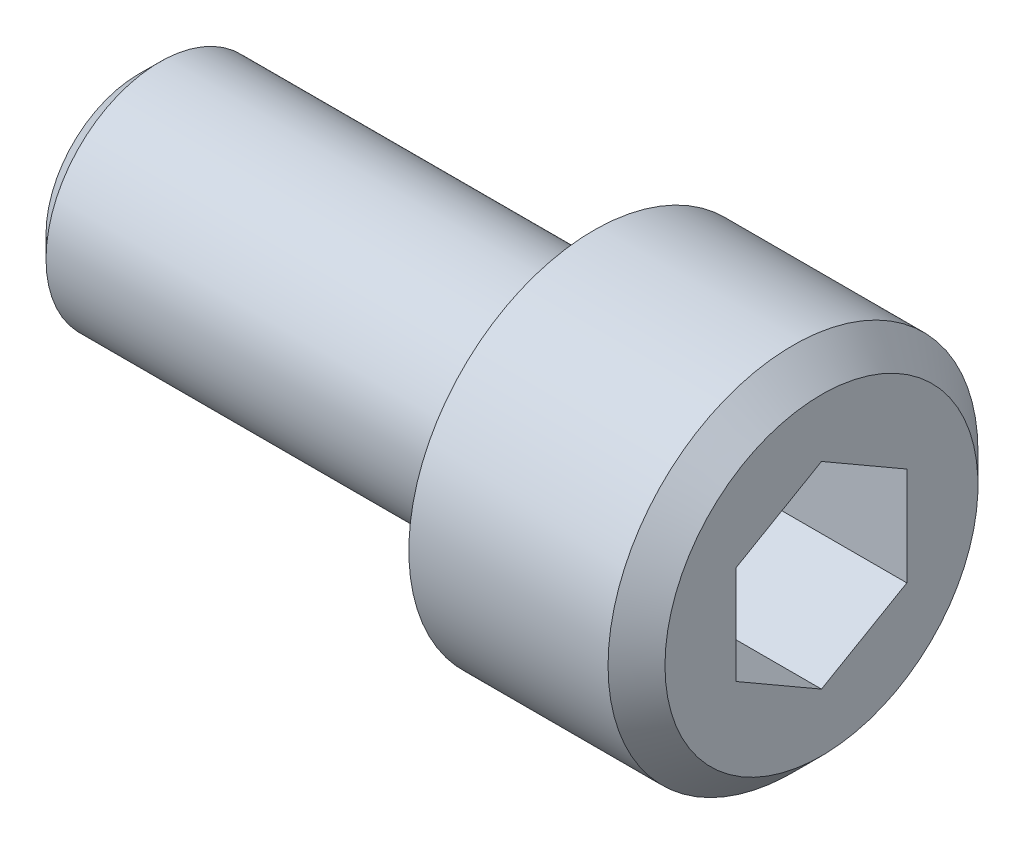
ISO-10303-21;
HEADER;
FILE_DESCRIPTION(('STEP AP214'),'2;1');
FILE_NAME('part.step','',(''),(''),'','','');
FILE_SCHEMA(('AUTOMOTIVE_DESIGN { 1 0 10303 214 1 1 1 1 }'));
ENDSEC;
DATA;
#1=APPLICATION_CONTEXT('core data for automotive mechanical design processes');
#2=APPLICATION_PROTOCOL_DEFINITION('international standard','automotive_design',2000,#1);
#3=PRODUCT_CONTEXT('',#1,'mechanical');
#4=PRODUCT('Part','Part','',(#3));
#5=PRODUCT_RELATED_PRODUCT_CATEGORY('part','',(#4));
#6=PRODUCT_DEFINITION_FORMATION('','',#4);
#7=PRODUCT_DEFINITION_CONTEXT('part definition',#1,'design');
#8=PRODUCT_DEFINITION('design','',#6,#7);
#9=PRODUCT_DEFINITION_SHAPE('','',#8);
#10=(LENGTH_UNIT() NAMED_UNIT(*) SI_UNIT(.MILLI.,.METRE.));
#11=(NAMED_UNIT(*) PLANE_ANGLE_UNIT() SI_UNIT($,.RADIAN.));
#12=(NAMED_UNIT(*) SI_UNIT($,.STERADIAN.) SOLID_ANGLE_UNIT());
#13=UNCERTAINTY_MEASURE_WITH_UNIT(LENGTH_MEASURE(1.E-05),#10,'distance_accuracy_value','');
#14=(GEOMETRIC_REPRESENTATION_CONTEXT(3) GLOBAL_UNCERTAINTY_ASSIGNED_CONTEXT((#13)) GLOBAL_UNIT_ASSIGNED_CONTEXT((#10,
#11,#12)) REPRESENTATION_CONTEXT('',''));
#15=CARTESIAN_POINT('',(0.,0.,0.));
#16=DIRECTION('',(0.,0.,1.));
#17=DIRECTION('',(1.,0.,0.));
#18=AXIS2_PLACEMENT_3D('',#15,#16,#17);
#19=CARTESIAN_POINT('',(19.,0.,0.));
#20=DIRECTION('',(1.,0.,0.));
#21=DIRECTION('',(0.,0.,-1.));
#22=AXIS2_PLACEMENT_3D('',#19,#20,#21);
#23=PLANE('',#22);
#24=DIRECTION('',(0.,-0.5,0.866025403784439));
#25=VECTOR('',#24,1.);
#26=CARTESIAN_POINT('',(19.,3.46410161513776,0.));
#27=LINE('',#26,#25);
#28=CARTESIAN_POINT('',(19.,3.46410161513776,0.));
#29=VERTEX_POINT('',#28);
#30=CARTESIAN_POINT('',(19.,1.73205080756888,3.));
#31=VERTEX_POINT('',#30);
#32=EDGE_CURVE('E83',#29,#31,#27,.T.);
#33=ORIENTED_EDGE('',*,*,#32,.T.);
#34=DIRECTION('',(0.,1.,0.));
#35=VECTOR('',#34,1.);
#36=CARTESIAN_POINT('',(19.,1.73205080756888,3.));
#37=LINE('',#36,#35);
#38=CARTESIAN_POINT('',(19.,-1.73205080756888,3.));
#39=VERTEX_POINT('',#38);
#40=EDGE_CURVE('E67',#31,#39,#37,.F.);
#41=ORIENTED_EDGE('',*,*,#40,.T.);
#42=DIRECTION('',(0.,-0.5,-0.866025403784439));
#43=VECTOR('',#42,1.);
#44=CARTESIAN_POINT('',(19.,-1.73205080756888,3.));
#45=LINE('',#44,#43);
#46=CARTESIAN_POINT('',(19.,-3.46410161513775,0.));
#47=VERTEX_POINT('',#46);
#48=EDGE_CURVE('E72',#39,#47,#45,.T.);
#49=ORIENTED_EDGE('',*,*,#48,.T.);
#50=DIRECTION('',(0.,0.5,-0.866025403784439));
#51=VECTOR('',#50,1.);
#52=CARTESIAN_POINT('',(19.,-3.46410161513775,0.));
#53=LINE('',#52,#51);
#54=CARTESIAN_POINT('',(19.,-1.73205080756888,-3.));
#55=VERTEX_POINT('',#54);
#56=EDGE_CURVE('E128',#47,#55,#53,.T.);
#57=ORIENTED_EDGE('',*,*,#56,.T.);
#58=DIRECTION('',(0.,1.,0.));
#59=VECTOR('',#58,1.);
#60=CARTESIAN_POINT('',(19.,-1.73205080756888,-3.));
#61=LINE('',#60,#59);
#62=CARTESIAN_POINT('',(19.,1.73205080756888,-3.));
#63=VERTEX_POINT('',#62);
#64=EDGE_CURVE('E132',#55,#63,#61,.T.);
#65=ORIENTED_EDGE('',*,*,#64,.T.);
#66=DIRECTION('',(0.,0.5,0.866025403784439));
#67=VECTOR('',#66,1.);
#68=CARTESIAN_POINT('',(19.,1.73205080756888,-3.));
#69=LINE('',#68,#67);
#70=EDGE_CURVE('E137',#63,#29,#69,.T.);
#71=ORIENTED_EDGE('',*,*,#70,.T.);
#72=EDGE_LOOP('',(#33,#41,#49,#57,#65,#71));
#73=FACE_BOUND('',#72,.T.);
#74=ADVANCED_FACE('F17',(#73),#23,.T.);
#75=CARTESIAN_POINT('',(24.,-1.73205080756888,3.));
#76=DIRECTION('',(0.,-0.866025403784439,0.5));
#77=DIRECTION('',(0.,-0.5,-0.866025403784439));
#78=AXIS2_PLACEMENT_3D('',#75,#76,#77);
#79=PLANE('',#78);
#80=DIRECTION('',(1.,0.,0.));
#81=VECTOR('',#80,1.);
#82=CARTESIAN_POINT('',(24.,-1.73205080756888,3.));
#83=LINE('',#82,#81);
#84=CARTESIAN_POINT('',(24.,-1.73205080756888,3.));
#85=VERTEX_POINT('',#84);
#86=EDGE_CURVE('E74',#39,#85,#83,.T.);
#87=ORIENTED_EDGE('',*,*,#86,.T.);
#88=DIRECTION('',(0.,0.5,0.866025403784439));
#89=VECTOR('',#88,1.);
#90=CARTESIAN_POINT('',(24.,-3.46410161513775,0.));
#91=LINE('',#90,#89);
#92=CARTESIAN_POINT('',(24.,-3.46410161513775,0.));
#93=VERTEX_POINT('',#92);
#94=EDGE_CURVE('E126',#93,#85,#91,.T.);
#95=ORIENTED_EDGE('',*,*,#94,.F.);
#96=DIRECTION('',(1.,0.,0.));
#97=VECTOR('',#96,1.);
#98=CARTESIAN_POINT('',(24.,-3.46410161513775,0.));
#99=LINE('',#98,#97);
#100=EDGE_CURVE('E77',#93,#47,#99,.F.);
#101=ORIENTED_EDGE('',*,*,#100,.T.);
#102=ORIENTED_EDGE('',*,*,#48,.F.);
#103=EDGE_LOOP('',(#87,#95,#101,#102));
#104=FACE_BOUND('',#103,.T.);
#105=ADVANCED_FACE('F73',(#104),#79,.F.);
#106=CARTESIAN_POINT('',(24.,1.73205080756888,3.));
#107=DIRECTION('',(0.,0.,1.));
#108=DIRECTION('',(1.,0.,0.));
#109=AXIS2_PLACEMENT_3D('',#106,#107,#108);
#110=PLANE('',#109);
#111=DIRECTION('',(1.,0.,0.));
#112=VECTOR('',#111,1.);
#113=CARTESIAN_POINT('',(24.,1.73205080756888,3.));
#114=LINE('',#113,#112);
#115=CARTESIAN_POINT('',(24.,1.73205080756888,3.));
#116=VERTEX_POINT('',#115);
#117=EDGE_CURVE('E85',#31,#116,#114,.T.);
#118=ORIENTED_EDGE('',*,*,#117,.T.);
#119=DIRECTION('',(0.,1.,0.));
#120=VECTOR('',#119,1.);
#121=CARTESIAN_POINT('',(24.,2.75,3.));
#122=LINE('',#121,#120);
#123=EDGE_CURVE('E89',#85,#116,#122,.T.);
#124=ORIENTED_EDGE('',*,*,#123,.F.);
#125=ORIENTED_EDGE('',*,*,#86,.F.);
#126=ORIENTED_EDGE('',*,*,#40,.F.);
#127=EDGE_LOOP('',(#118,#124,#125,#126));
#128=FACE_BOUND('',#127,.T.);
#129=ADVANCED_FACE('F87',(#128),#110,.F.);
#130=CARTESIAN_POINT('',(24.,3.46410161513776,0.));
#131=DIRECTION('',(0.,0.866025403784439,0.5));
#132=DIRECTION('',(0.,-0.5,0.866025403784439));
#133=AXIS2_PLACEMENT_3D('',#130,#131,#132);
#134=PLANE('',#133);
#135=DIRECTION('',(1.,0.,0.));
#136=VECTOR('',#135,1.);
#137=CARTESIAN_POINT('',(24.,3.46410161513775,0.));
#138=LINE('',#137,#136);
#139=CARTESIAN_POINT('',(24.,3.46410161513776,0.));
#140=VERTEX_POINT('',#139);
#141=EDGE_CURVE('E139',#29,#140,#138,.T.);
#142=ORIENTED_EDGE('',*,*,#141,.T.);
#143=DIRECTION('',(0.,0.5,-0.866025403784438));
#144=VECTOR('',#143,1.);
#145=CARTESIAN_POINT('',(24.,1.73205080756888,3.));
#146=LINE('',#145,#144);
#147=EDGE_CURVE('E122',#116,#140,#146,.T.);
#148=ORIENTED_EDGE('',*,*,#147,.F.);
#149=ORIENTED_EDGE('',*,*,#117,.F.);
#150=ORIENTED_EDGE('',*,*,#32,.F.);
#151=EDGE_LOOP('',(#142,#148,#149,#150));
#152=FACE_BOUND('',#151,.T.);
#153=ADVANCED_FACE('F143',(#152),#134,.F.);
#154=CARTESIAN_POINT('',(24.,1.73205080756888,-3.));
#155=DIRECTION('',(0.,0.866025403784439,-0.5));
#156=DIRECTION('',(0.,0.5,0.866025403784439));
#157=AXIS2_PLACEMENT_3D('',#154,#155,#156);
#158=PLANE('',#157);
#159=DIRECTION('',(-1.,0.,0.));
#160=VECTOR('',#159,1.);
#161=CARTESIAN_POINT('',(24.,1.73205080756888,-3.));
#162=LINE('',#161,#160);
#163=CARTESIAN_POINT('',(24.,1.73205080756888,-3.));
#164=VERTEX_POINT('',#163);
#165=EDGE_CURVE('E135',#63,#164,#162,.F.);
#166=ORIENTED_EDGE('',*,*,#165,.T.);
#167=DIRECTION('',(0.,-0.5,-0.866025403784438));
#168=VECTOR('',#167,1.);
#169=CARTESIAN_POINT('',(24.,3.46410161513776,0.));
#170=LINE('',#169,#168);
#171=EDGE_CURVE('E119',#140,#164,#170,.T.);
#172=ORIENTED_EDGE('',*,*,#171,.F.);
#173=ORIENTED_EDGE('',*,*,#141,.F.);
#174=ORIENTED_EDGE('',*,*,#70,.F.);
#175=EDGE_LOOP('',(#166,#172,#173,#174));
#176=FACE_BOUND('',#175,.T.);
#177=ADVANCED_FACE('F154',(#176),#158,.F.);
#178=CARTESIAN_POINT('',(24.,-1.73205080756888,-3.));
#179=DIRECTION('',(0.,0.,-1.));
#180=DIRECTION('',(-1.,0.,0.));
#181=AXIS2_PLACEMENT_3D('',#178,#179,#180);
#182=PLANE('',#181);
#183=DIRECTION('',(1.,0.,0.));
#184=VECTOR('',#183,1.);
#185=CARTESIAN_POINT('',(24.,-1.73205080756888,-3.));
#186=LINE('',#185,#184);
#187=CARTESIAN_POINT('',(24.,-1.73205080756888,-3.));
#188=VERTEX_POINT('',#187);
#189=EDGE_CURVE('E35',#55,#188,#186,.T.);
#190=ORIENTED_EDGE('',*,*,#189,.T.);
#191=DIRECTION('',(0.,1.,0.));
#192=VECTOR('',#191,1.);
#193=CARTESIAN_POINT('',(24.,2.75,-3.));
#194=LINE('',#193,#192);
#195=EDGE_CURVE('E116',#164,#188,#194,.F.);
#196=ORIENTED_EDGE('',*,*,#195,.F.);
#197=ORIENTED_EDGE('',*,*,#165,.F.);
#198=ORIENTED_EDGE('',*,*,#64,.F.);
#199=EDGE_LOOP('',(#190,#196,#197,#198));
#200=FACE_BOUND('',#199,.T.);
#201=ADVANCED_FACE('F152',(#200),#182,.F.);
#202=CARTESIAN_POINT('',(24.,-3.46410161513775,0.));
#203=DIRECTION('',(0.,-0.866025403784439,-0.5));
#204=DIRECTION('',(0.,0.5,-0.866025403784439));
#205=AXIS2_PLACEMENT_3D('',#202,#203,#204);
#206=PLANE('',#205);
#207=ORIENTED_EDGE('',*,*,#100,.F.);
#208=DIRECTION('',(0.,-0.5,0.866025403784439));
#209=VECTOR('',#208,1.);
#210=CARTESIAN_POINT('',(24.,-1.73205080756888,-3.));
#211=LINE('',#210,#209);
#212=EDGE_CURVE('E108',#188,#93,#211,.T.);
#213=ORIENTED_EDGE('',*,*,#212,.F.);
#214=ORIENTED_EDGE('',*,*,#189,.F.);
#215=ORIENTED_EDGE('',*,*,#56,.F.);
#216=EDGE_LOOP('',(#207,#213,#214,#215));
#217=FACE_BOUND('',#216,.T.);
#218=ADVANCED_FACE('F150',(#217),#206,.F.);
#219=CARTESIAN_POINT('',(24.,2.75,0.));
#220=DIRECTION('',(1.,0.,0.));
#221=DIRECTION('',(0.,0.,-1.));
#222=AXIS2_PLACEMENT_3D('',#219,#220,#221);
#223=PLANE('',#222);
#224=ORIENTED_EDGE('',*,*,#195,.T.);
#225=ORIENTED_EDGE('',*,*,#212,.T.);
#226=ORIENTED_EDGE('',*,*,#94,.T.);
#227=ORIENTED_EDGE('',*,*,#123,.T.);
#228=ORIENTED_EDGE('',*,*,#147,.T.);
#229=ORIENTED_EDGE('',*,*,#171,.T.);
#230=EDGE_LOOP('',(#224,#225,#226,#227,#228,#229));
#231=FACE_BOUND('',#230,.T.);
#232=CARTESIAN_POINT('',(24.0000000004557,0.,0.));
#233=DIRECTION('',(-1.,0.,0.));
#234=DIRECTION('',(0.,0.,1.));
#235=AXIS2_PLACEMENT_3D('',#232,#233,#234);
#236=CIRCLE('',#235,5.50000000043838);
#237=CARTESIAN_POINT('',(24.0000000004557,0.,5.50000000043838));
#238=VERTEX_POINT('',#237);
#239=EDGE_CURVE('E20',#238,#238,#236,.T.);
#240=ORIENTED_EDGE('',*,*,#239,.F.);
#241=EDGE_LOOP('',(#240));
#242=FACE_BOUND('',#241,.T.);
#243=ADVANCED_FACE('F147',(#231,#242),#223,.T.);
#244=CARTESIAN_POINT('',(22.9999999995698,0.,0.));
#245=DIRECTION('',(-1.,0.,0.));
#246=DIRECTION('',(0.,0.,1.));
#247=AXIS2_PLACEMENT_3D('',#244,#245,#246);
#248=CONICAL_SURFACE('',#247,6.49999999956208,0.785398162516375);
#249=CARTESIAN_POINT('',(23.,0.,0.));
#250=DIRECTION('',(1.,0.,0.));
#251=DIRECTION('',(0.,0.,-1.));
#252=AXIS2_PLACEMENT_3D('',#249,#250,#251);
#253=CIRCLE('',#252,6.5);
#254=CARTESIAN_POINT('',(23.,0.,-6.5));
#255=VERTEX_POINT('',#254);
#256=EDGE_CURVE('E100',#255,#255,#253,.F.);
#257=ORIENTED_EDGE('',*,*,#256,.F.);
#258=EDGE_LOOP('',(#257));
#259=FACE_BOUND('',#258,.T.);
#260=ORIENTED_EDGE('',*,*,#239,.T.);
#261=EDGE_LOOP('',(#260));
#262=FACE_BOUND('',#261,.T.);
#263=ADVANCED_FACE('F187',(#259,#262),#248,.T.);
#264=CARTESIAN_POINT('',(19.5,0.,0.));
#265=DIRECTION('',(1.,0.,0.));
#266=DIRECTION('',(0.,0.,-1.));
#267=AXIS2_PLACEMENT_3D('',#264,#265,#266);
#268=CYLINDRICAL_SURFACE('',#267,6.5);
#269=CARTESIAN_POINT('',(16.,0.,0.));
#270=DIRECTION('',(1.,0.,0.));
#271=DIRECTION('',(0.,0.,-1.));
#272=AXIS2_PLACEMENT_3D('',#269,#270,#271);
#273=CIRCLE('',#272,6.5);
#274=CARTESIAN_POINT('',(16.,0.,-6.5));
#275=VERTEX_POINT('',#274);
#276=EDGE_CURVE('E98',#275,#275,#273,.F.);
#277=ORIENTED_EDGE('',*,*,#276,.F.);
#278=EDGE_LOOP('',(#277));
#279=FACE_BOUND('',#278,.T.);
#280=ORIENTED_EDGE('',*,*,#256,.T.);
#281=EDGE_LOOP('',(#280));
#282=FACE_BOUND('',#281,.T.);
#283=ADVANCED_FACE('F183',(#279,#282),#268,.T.);
#284=CARTESIAN_POINT('',(0.,1.625,0.));
#285=DIRECTION('',(-1.,0.,0.));
#286=DIRECTION('',(0.,0.,1.));
#287=AXIS2_PLACEMENT_3D('',#284,#285,#286);
#288=PLANE('',#287);
#289=CARTESIAN_POINT('',(-2.8421709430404E-10,0.,0.));
#290=DIRECTION('',(1.,0.,0.));
#291=DIRECTION('',(0.,0.,-1.));
#292=AXIS2_PLACEMENT_3D('',#289,#290,#291);
#293=CIRCLE('',#292,3.2500000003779);
#294=CARTESIAN_POINT('',(-2.8421709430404E-10,0.,-3.2500000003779));
#295=VERTEX_POINT('',#294);
#296=EDGE_CURVE('E96',#295,#295,#293,.T.);
#297=ORIENTED_EDGE('',*,*,#296,.F.);
#298=EDGE_LOOP('',(#297));
#299=FACE_BOUND('',#298,.T.);
#300=ADVANCED_FACE('F179',(#299),#288,.T.);
#301=CARTESIAN_POINT('',(16.,5.25,0.));
#302=DIRECTION('',(-1.,0.,0.));
#303=DIRECTION('',(0.,0.,1.));
#304=AXIS2_PLACEMENT_3D('',#301,#302,#303);
#305=PLANE('',#304);
#306=CARTESIAN_POINT('',(16.,0.,0.));
#307=DIRECTION('',(1.,0.,0.));
#308=DIRECTION('',(0.,0.,-1.));
#309=AXIS2_PLACEMENT_3D('',#306,#307,#308);
#310=CIRCLE('',#309,4.);
#311=CARTESIAN_POINT('',(16.,0.,-4.));
#312=VERTEX_POINT('',#311);
#313=EDGE_CURVE('E26',#312,#312,#310,.F.);
#314=ORIENTED_EDGE('',*,*,#313,.F.);
#315=EDGE_LOOP('',(#314));
#316=FACE_BOUND('',#315,.T.);
#317=ORIENTED_EDGE('',*,*,#276,.T.);
#318=EDGE_LOOP('',(#317));
#319=FACE_BOUND('',#318,.T.);
#320=ADVANCED_FACE('F172',(#316,#319),#305,.T.);
#321=CARTESIAN_POINT('',(0.750000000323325,0.,0.));
#322=DIRECTION('',(1.,0.,0.));
#323=DIRECTION('',(0.,0.,-1.));
#324=AXIS2_PLACEMENT_3D('',#321,#322,#323);
#325=CONICAL_SURFACE('',#324,3.9999999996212,0.785398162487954);
#326=ORIENTED_EDGE('',*,*,#296,.T.);
#327=EDGE_LOOP('',(#326));
#328=FACE_BOUND('',#327,.T.);
#329=CARTESIAN_POINT('',(0.749999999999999,0.,0.));
#330=DIRECTION('',(1.,0.,0.));
#331=DIRECTION('',(0.,0.,-1.));
#332=AXIS2_PLACEMENT_3D('',#329,#330,#331);
#333=CIRCLE('',#332,4.);
#334=CARTESIAN_POINT('',(0.749999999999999,0.,-4.));
#335=VERTEX_POINT('',#334);
#336=EDGE_CURVE('E11',#335,#335,#333,.T.);
#337=ORIENTED_EDGE('',*,*,#336,.F.);
#338=EDGE_LOOP('',(#337));
#339=FACE_BOUND('',#338,.T.);
#340=ADVANCED_FACE('F166',(#328,#339),#325,.T.);
#341=CARTESIAN_POINT('',(8.375,0.,0.));
#342=DIRECTION('',(1.,0.,0.));
#343=DIRECTION('',(0.,0.,-1.));
#344=AXIS2_PLACEMENT_3D('',#341,#342,#343);
#345=CYLINDRICAL_SURFACE('',#344,4.);
#346=ORIENTED_EDGE('',*,*,#336,.T.);
#347=EDGE_LOOP('',(#346));
#348=FACE_BOUND('',#347,.T.);
#349=ORIENTED_EDGE('',*,*,#313,.T.);
#350=EDGE_LOOP('',(#349));
#351=FACE_BOUND('',#350,.T.);
#352=ADVANCED_FACE('F164',(#348,#351),#345,.T.);
#353=CLOSED_SHELL('',(#74,#105,#129,#153,#177,#201,#218,#243,#263,#283,#300,#320,#340,#352));
#354=MANIFOLD_SOLID_BREP('B1',#353);
#355=ADVANCED_BREP_SHAPE_REPRESENTATION('',(#18,#354),#14);
#356=SHAPE_DEFINITION_REPRESENTATION(#9,#355);
ENDSEC;
END-ISO-10303-21;
